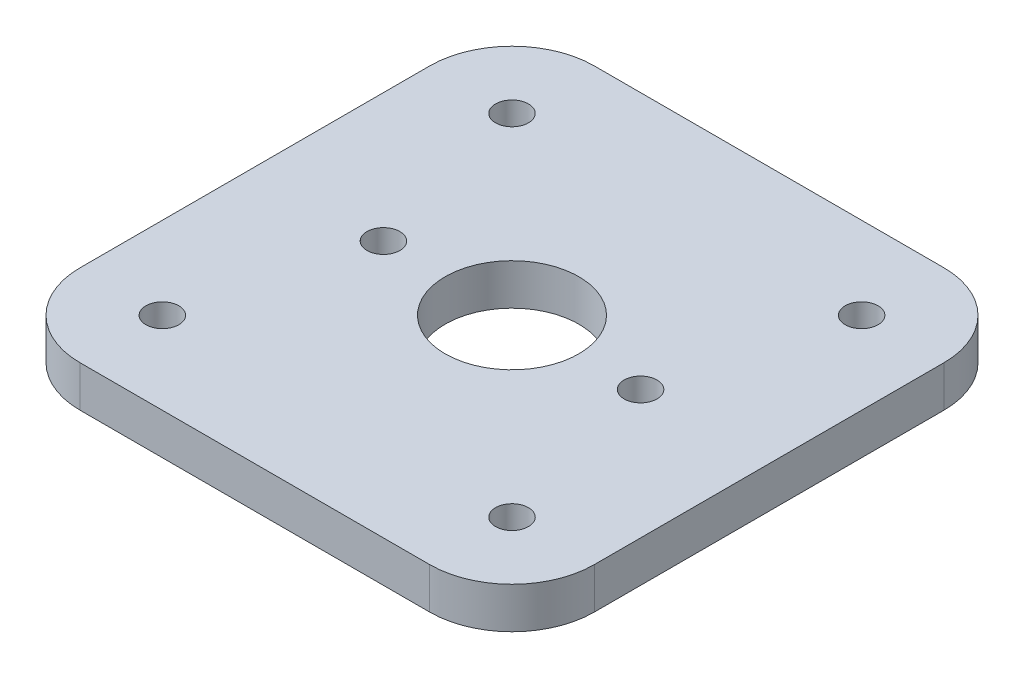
from build123d import *

# Parameters (mm, degrees)
SKIZZE1_R                       = 6.5
SKIZZE1_R_2                     = 1.6
AUFSATZ_LINEAR_AUSTRAGEN1_DEPTH = 4


with BuildPart() as part:
    # Skizze1 → Aufsatz-Linear austragen1 (new body)
    with BuildSketch(Plane(origin=(0, 0, 0), x_dir=(1, 0, 0), z_dir=(0, 1, 0))):
        with BuildLine():
            Line((-17, 25), (17, 25))
            ThreePointArc((17, 25), (22.656854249, 22.656854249), (25, 17))
            Line((25, 17), (25, -17))
            ThreePointArc((25, -17), (22.656854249, -22.656854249), (17, -25))
            Line((17, -25), (-17, -25))
            ThreePointArc((-17, -25), (-22.656854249, -22.656854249), (-25, -17))
            Line((-25, -17), (-25, 17))
            ThreePointArc((-25, 17), (-22.656854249, 22.656854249), (-17, 25))
        make_face()
        with Locations(Location((0, 0, 0), (0, 0, 270))):
            Circle(SKIZZE1_R, mode=Mode.SUBTRACT)
        with Locations(Location((-12.5, 0, 0), (0, 0, 270))):
            Circle(SKIZZE1_R_2, mode=Mode.SUBTRACT)
        with Locations(Location((12.5, 0, 0), (0, 0, 90))):
            Circle(SKIZZE1_R_2, mode=Mode.SUBTRACT)
        with Locations(Location((-17, 17, 0), (0, 0, 270))):
            Circle(SKIZZE1_R_2, mode=Mode.SUBTRACT)
        with Locations(Location((17, 17, 0), (0, 0, 90))):
            Circle(SKIZZE1_R_2, mode=Mode.SUBTRACT)
        with Locations(Location((-17, -17, 0), (0, 0, 90))):
            Circle(SKIZZE1_R_2, mode=Mode.SUBTRACT)
        with Locations(Location((17, -17, 0), (0, 0, 270))):
            Circle(SKIZZE1_R_2, mode=Mode.SUBTRACT)
    extrude(amount=AUFSATZ_LINEAR_AUSTRAGEN1_DEPTH)


solid = part.part
